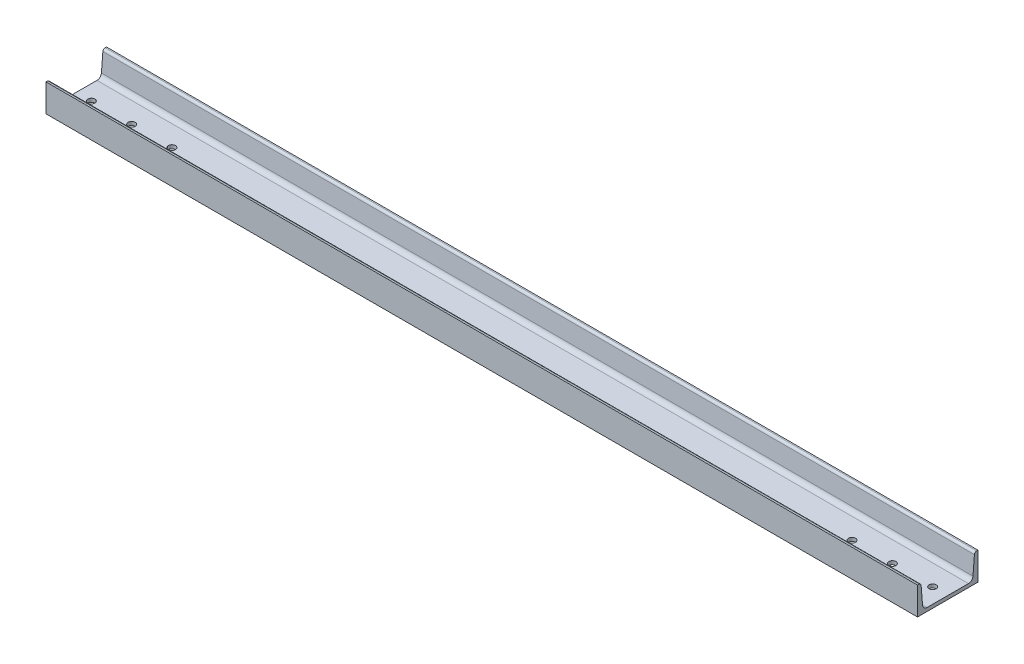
ISO-10303-21;
HEADER;
FILE_DESCRIPTION(('STEP AP214'),'2;1');
FILE_NAME('part.step','',(''),(''),'','','');
FILE_SCHEMA(('AUTOMOTIVE_DESIGN { 1 0 10303 214 1 1 1 1 }'));
ENDSEC;
DATA;
#1=APPLICATION_CONTEXT('core data for automotive mechanical design processes');
#2=APPLICATION_PROTOCOL_DEFINITION('international standard','automotive_design',2000,#1);
#3=PRODUCT_CONTEXT('',#1,'mechanical');
#4=PRODUCT('Part','Part','',(#3));
#5=PRODUCT_RELATED_PRODUCT_CATEGORY('part','',(#4));
#6=PRODUCT_DEFINITION_FORMATION('','',#4);
#7=PRODUCT_DEFINITION_CONTEXT('part definition',#1,'design');
#8=PRODUCT_DEFINITION('design','',#6,#7);
#9=PRODUCT_DEFINITION_SHAPE('','',#8);
#10=(LENGTH_UNIT() NAMED_UNIT(*) SI_UNIT(.MILLI.,.METRE.));
#11=(NAMED_UNIT(*) PLANE_ANGLE_UNIT() SI_UNIT($,.RADIAN.));
#12=(NAMED_UNIT(*) SI_UNIT($,.STERADIAN.) SOLID_ANGLE_UNIT());
#13=UNCERTAINTY_MEASURE_WITH_UNIT(LENGTH_MEASURE(1.E-05),#10,'distance_accuracy_value','');
#14=(GEOMETRIC_REPRESENTATION_CONTEXT(3) GLOBAL_UNCERTAINTY_ASSIGNED_CONTEXT((#13)) GLOBAL_UNIT_ASSIGNED_CONTEXT((#10,
#11,#12)) REPRESENTATION_CONTEXT('',''));
#15=CARTESIAN_POINT('',(0.,0.,0.));
#16=DIRECTION('',(0.,0.,1.));
#17=DIRECTION('',(1.,0.,0.));
#18=AXIS2_PLACEMENT_3D('',#15,#16,#17);
#19=CARTESIAN_POINT('',(865.,7.,-41.0520874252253));
#20=DIRECTION('',(0.,-1.,0.));
#21=DIRECTION('',(0.,0.,-1.));
#22=AXIS2_PLACEMENT_3D('',#19,#20,#21);
#23=PLANE('',#22);
#24=CARTESIAN_POINT('',(-755.,7.,0.));
#25=DIRECTION('',(0.,-1.,0.));
#26=DIRECTION('',(0.,0.,-1.));
#27=AXIS2_PLACEMENT_3D('',#24,#25,#26);
#28=CIRCLE('',#27,6.99999999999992);
#29=CARTESIAN_POINT('',(-755.,7.,-6.99999999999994));
#30=VERTEX_POINT('',#29);
#31=EDGE_CURVE('E287',#30,#30,#28,.F.);
#32=ORIENTED_EDGE('',*,*,#31,.F.);
#33=EDGE_LOOP('',(#32));
#34=FACE_BOUND('',#33,.T.);
#35=DIRECTION('',(0.,0.,1.));
#36=VECTOR('',#35,1.);
#37=CARTESIAN_POINT('',(-865.,7.,-41.0520874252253));
#38=LINE('',#37,#36);
#39=CARTESIAN_POINT('',(-865.,7.,-41.0520874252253));
#40=VERTEX_POINT('',#39);
#41=CARTESIAN_POINT('',(-865.,7.,41.0520874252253));
#42=VERTEX_POINT('',#41);
#43=EDGE_CURVE('E150',#40,#42,#38,.T.);
#44=ORIENTED_EDGE('',*,*,#43,.T.);
#45=DIRECTION('',(-1.,0.,0.));
#46=VECTOR('',#45,1.);
#47=CARTESIAN_POINT('',(865.,7.,41.0520874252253));
#48=LINE('',#47,#46);
#49=CARTESIAN_POINT('',(865.,7.,41.0520874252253));
#50=VERTEX_POINT('',#49);
#51=EDGE_CURVE('E201',#50,#42,#48,.T.);
#52=ORIENTED_EDGE('',*,*,#51,.F.);
#53=DIRECTION('',(0.,0.,1.));
#54=VECTOR('',#53,1.);
#55=CARTESIAN_POINT('',(865.,7.,-41.0520874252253));
#56=LINE('',#55,#54);
#57=CARTESIAN_POINT('',(865.,7.,-41.0520874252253));
#58=VERTEX_POINT('',#57);
#59=EDGE_CURVE('E173',#58,#50,#56,.T.);
#60=ORIENTED_EDGE('',*,*,#59,.F.);
#61=DIRECTION('',(-1.,0.,0.));
#62=VECTOR('',#61,1.);
#63=CARTESIAN_POINT('',(865.,7.,-41.0520874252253));
#64=LINE('',#63,#62);
#65=EDGE_CURVE('E204',#58,#40,#64,.T.);
#66=ORIENTED_EDGE('',*,*,#65,.T.);
#67=EDGE_LOOP('',(#44,#52,#60,#66));
#68=FACE_BOUND('',#67,.T.);
#69=CARTESIAN_POINT('',(835.,7.,0.));
#70=DIRECTION('',(0.,-1.,0.));
#71=DIRECTION('',(0.,0.,-1.));
#72=AXIS2_PLACEMENT_3D('',#69,#70,#71);
#73=CIRCLE('',#72,6.99999999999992);
#74=CARTESIAN_POINT('',(835.,7.,-6.99999999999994));
#75=VERTEX_POINT('',#74);
#76=EDGE_CURVE('E138',#75,#75,#73,.T.);
#77=ORIENTED_EDGE('',*,*,#76,.T.);
#78=EDGE_LOOP('',(#77));
#79=FACE_BOUND('',#78,.T.);
#80=CARTESIAN_POINT('',(755.,7.,0.));
#81=DIRECTION('',(0.,-1.,0.));
#82=DIRECTION('',(0.,0.,-1.));
#83=AXIS2_PLACEMENT_3D('',#80,#81,#82);
#84=CIRCLE('',#83,6.99999999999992);
#85=CARTESIAN_POINT('',(755.,7.,-6.99999999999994));
#86=VERTEX_POINT('',#85);
#87=EDGE_CURVE('E299',#86,#86,#84,.T.);
#88=ORIENTED_EDGE('',*,*,#87,.T.);
#89=EDGE_LOOP('',(#88));
#90=FACE_BOUND('',#89,.T.);
#91=CARTESIAN_POINT('',(675.,7.,0.));
#92=DIRECTION('',(0.,-1.,0.));
#93=DIRECTION('',(0.,0.,-1.));
#94=AXIS2_PLACEMENT_3D('',#91,#92,#93);
#95=CIRCLE('',#94,6.99999999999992);
#96=CARTESIAN_POINT('',(675.,7.,-6.99999999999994));
#97=VERTEX_POINT('',#96);
#98=EDGE_CURVE('E295',#97,#97,#95,.T.);
#99=ORIENTED_EDGE('',*,*,#98,.T.);
#100=EDGE_LOOP('',(#99));
#101=FACE_BOUND('',#100,.T.);
#102=CARTESIAN_POINT('',(-835.,7.,0.));
#103=DIRECTION('',(0.,-1.,0.));
#104=DIRECTION('',(0.,0.,-1.));
#105=AXIS2_PLACEMENT_3D('',#102,#103,#104);
#106=CIRCLE('',#105,6.99999999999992);
#107=CARTESIAN_POINT('',(-835.,7.,-6.99999999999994));
#108=VERTEX_POINT('',#107);
#109=EDGE_CURVE('E291',#108,#108,#106,.F.);
#110=ORIENTED_EDGE('',*,*,#109,.F.);
#111=EDGE_LOOP('',(#110));
#112=FACE_BOUND('',#111,.T.);
#113=CARTESIAN_POINT('',(-675.,7.,0.));
#114=DIRECTION('',(0.,-1.,0.));
#115=DIRECTION('',(0.,0.,-1.));
#116=AXIS2_PLACEMENT_3D('',#113,#114,#115);
#117=CIRCLE('',#116,6.99999999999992);
#118=CARTESIAN_POINT('',(-675.,7.,-6.99999999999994));
#119=VERTEX_POINT('',#118);
#120=EDGE_CURVE('E279',#119,#119,#117,.F.);
#121=ORIENTED_EDGE('',*,*,#120,.F.);
#122=EDGE_LOOP('',(#121));
#123=FACE_BOUND('',#122,.T.);
#124=ADVANCED_FACE('F31',(#34,#68,#79,#90,#101,#112,#123),#23,.F.);
#125=CARTESIAN_POINT('',(865.,0.,60.));
#126=DIRECTION('',(0.,1.,0.));
#127=DIRECTION('',(0.,0.,1.));
#128=AXIS2_PLACEMENT_3D('',#125,#126,#127);
#129=PLANE('',#128);
#130=CARTESIAN_POINT('',(-755.,0.,0.));
#131=DIRECTION('',(0.,1.,0.));
#132=DIRECTION('',(0.,0.,-1.));
#133=AXIS2_PLACEMENT_3D('',#130,#131,#132);
#134=CIRCLE('',#133,6.99999999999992);
#135=CARTESIAN_POINT('',(-755.,0.,-6.99999999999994));
#136=VERTEX_POINT('',#135);
#137=EDGE_CURVE('E282',#136,#136,#134,.T.);
#138=ORIENTED_EDGE('',*,*,#137,.T.);
#139=EDGE_LOOP('',(#138));
#140=FACE_BOUND('',#139,.T.);
#141=DIRECTION('',(0.,0.,-1.));
#142=VECTOR('',#141,1.);
#143=CARTESIAN_POINT('',(-865.,0.,60.));
#144=LINE('',#143,#142);
#145=CARTESIAN_POINT('',(-865.,0.,60.));
#146=VERTEX_POINT('',#145);
#147=CARTESIAN_POINT('',(-865.,0.,-60.));
#148=VERTEX_POINT('',#147);
#149=EDGE_CURVE('E162',#146,#148,#144,.T.);
#150=ORIENTED_EDGE('',*,*,#149,.T.);
#151=DIRECTION('',(-1.,0.,0.));
#152=VECTOR('',#151,1.);
#153=CARTESIAN_POINT('',(865.,0.,-60.));
#154=LINE('',#153,#152);
#155=CARTESIAN_POINT('',(865.,0.,-60.));
#156=VERTEX_POINT('',#155);
#157=EDGE_CURVE('E137',#156,#148,#154,.T.);
#158=ORIENTED_EDGE('',*,*,#157,.F.);
#159=DIRECTION('',(0.,0.,-1.));
#160=VECTOR('',#159,1.);
#161=CARTESIAN_POINT('',(865.,0.,60.));
#162=LINE('',#161,#160);
#163=CARTESIAN_POINT('',(865.,0.,60.));
#164=VERTEX_POINT('',#163);
#165=EDGE_CURVE('E46',#164,#156,#162,.T.);
#166=ORIENTED_EDGE('',*,*,#165,.F.);
#167=DIRECTION('',(-1.,0.,0.));
#168=VECTOR('',#167,1.);
#169=CARTESIAN_POINT('',(865.,0.,60.));
#170=LINE('',#169,#168);
#171=EDGE_CURVE('E186',#164,#146,#170,.T.);
#172=ORIENTED_EDGE('',*,*,#171,.T.);
#173=EDGE_LOOP('',(#150,#158,#166,#172));
#174=FACE_BOUND('',#173,.T.);
#175=CARTESIAN_POINT('',(835.,0.,0.));
#176=DIRECTION('',(0.,-1.,0.));
#177=DIRECTION('',(0.,0.,-1.));
#178=AXIS2_PLACEMENT_3D('',#175,#176,#177);
#179=CIRCLE('',#178,6.99999999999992);
#180=CARTESIAN_POINT('',(835.,0.,-6.99999999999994));
#181=VERTEX_POINT('',#180);
#182=EDGE_CURVE('E141',#181,#181,#179,.T.);
#183=ORIENTED_EDGE('',*,*,#182,.F.);
#184=EDGE_LOOP('',(#183));
#185=FACE_BOUND('',#184,.T.);
#186=CARTESIAN_POINT('',(755.,0.,0.));
#187=DIRECTION('',(0.,-1.,0.));
#188=DIRECTION('',(0.,0.,-1.));
#189=AXIS2_PLACEMENT_3D('',#186,#187,#188);
#190=CIRCLE('',#189,6.99999999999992);
#191=CARTESIAN_POINT('',(755.,0.,-6.99999999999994));
#192=VERTEX_POINT('',#191);
#193=EDGE_CURVE('E266',#192,#192,#190,.T.);
#194=ORIENTED_EDGE('',*,*,#193,.F.);
#195=EDGE_LOOP('',(#194));
#196=FACE_BOUND('',#195,.T.);
#197=CARTESIAN_POINT('',(675.,0.,0.));
#198=DIRECTION('',(0.,-1.,0.));
#199=DIRECTION('',(0.,0.,-1.));
#200=AXIS2_PLACEMENT_3D('',#197,#198,#199);
#201=CIRCLE('',#200,6.99999999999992);
#202=CARTESIAN_POINT('',(675.,0.,-6.99999999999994));
#203=VERTEX_POINT('',#202);
#204=EDGE_CURVE('E270',#203,#203,#201,.T.);
#205=ORIENTED_EDGE('',*,*,#204,.F.);
#206=EDGE_LOOP('',(#205));
#207=FACE_BOUND('',#206,.T.);
#208=CARTESIAN_POINT('',(-835.,0.,0.));
#209=DIRECTION('',(0.,1.,0.));
#210=DIRECTION('',(0.,0.,-1.));
#211=AXIS2_PLACEMENT_3D('',#208,#209,#210);
#212=CIRCLE('',#211,6.99999999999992);
#213=CARTESIAN_POINT('',(-835.,0.,-6.99999999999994));
#214=VERTEX_POINT('',#213);
#215=EDGE_CURVE('E274',#214,#214,#212,.T.);
#216=ORIENTED_EDGE('',*,*,#215,.T.);
#217=EDGE_LOOP('',(#216));
#218=FACE_BOUND('',#217,.T.);
#219=CARTESIAN_POINT('',(-675.,0.,0.));
#220=DIRECTION('',(0.,1.,0.));
#221=DIRECTION('',(0.,0.,-1.));
#222=AXIS2_PLACEMENT_3D('',#219,#220,#221);
#223=CIRCLE('',#222,6.99999999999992);
#224=CARTESIAN_POINT('',(-675.,0.,-6.99999999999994));
#225=VERTEX_POINT('',#224);
#226=EDGE_CURVE('E277',#225,#225,#223,.T.);
#227=ORIENTED_EDGE('',*,*,#226,.T.);
#228=EDGE_LOOP('',(#227));
#229=FACE_BOUND('',#228,.T.);
#230=ADVANCED_FACE('F255',(#140,#174,#185,#196,#207,#218,#229),#129,.F.);
#231=CARTESIAN_POINT('',(865.,0.,-60.));
#232=DIRECTION('',(0.,0.,1.));
#233=DIRECTION('',(0.,-1.,0.));
#234=AXIS2_PLACEMENT_3D('',#231,#232,#233);
#235=PLANE('',#234);
#236=DIRECTION('',(0.,1.,0.));
#237=VECTOR('',#236,1.);
#238=CARTESIAN_POINT('',(-865.,0.,-60.));
#239=LINE('',#238,#237);
#240=CARTESIAN_POINT('',(-865.,55.,-60.));
#241=VERTEX_POINT('',#240);
#242=EDGE_CURVE('E124',#148,#241,#239,.T.);
#243=ORIENTED_EDGE('',*,*,#242,.T.);
#244=DIRECTION('',(-1.,0.,0.));
#245=VECTOR('',#244,1.);
#246=CARTESIAN_POINT('',(865.,55.,-60.));
#247=LINE('',#246,#245);
#248=CARTESIAN_POINT('',(865.,55.,-60.));
#249=VERTEX_POINT('',#248);
#250=EDGE_CURVE('E11',#249,#241,#247,.T.);
#251=ORIENTED_EDGE('',*,*,#250,.F.);
#252=DIRECTION('',(0.,1.,0.));
#253=VECTOR('',#252,1.);
#254=CARTESIAN_POINT('',(865.,0.,-60.));
#255=LINE('',#254,#253);
#256=EDGE_CURVE('E164',#156,#249,#255,.T.);
#257=ORIENTED_EDGE('',*,*,#256,.F.);
#258=ORIENTED_EDGE('',*,*,#157,.T.);
#259=EDGE_LOOP('',(#243,#251,#257,#258));
#260=FACE_BOUND('',#259,.T.);
#261=ADVANCED_FACE('F33',(#260),#235,.F.);
#262=CARTESIAN_POINT('',(865.,55.,-60.));
#263=DIRECTION('',(0.,-1.,0.));
#264=DIRECTION('',(0.,0.,-1.));
#265=AXIS2_PLACEMENT_3D('',#262,#263,#264);
#266=PLANE('',#265);
#267=DIRECTION('',(0.,0.,1.));
#268=VECTOR('',#267,1.);
#269=CARTESIAN_POINT('',(-865.,55.,-60.));
#270=LINE('',#269,#268);
#271=CARTESIAN_POINT('',(-865.,55.,-57.3527681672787));
#272=VERTEX_POINT('',#271);
#273=EDGE_CURVE('E120',#241,#272,#270,.T.);
#274=ORIENTED_EDGE('',*,*,#273,.T.);
#275=DIRECTION('',(-1.,0.,0.));
#276=VECTOR('',#275,1.);
#277=CARTESIAN_POINT('',(865.,55.,-57.3527681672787));
#278=LINE('',#277,#276);
#279=CARTESIAN_POINT('',(865.,55.,-57.3527681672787));
#280=VERTEX_POINT('',#279);
#281=EDGE_CURVE('E39',#280,#272,#278,.T.);
#282=ORIENTED_EDGE('',*,*,#281,.F.);
#283=DIRECTION('',(0.,0.,1.));
#284=VECTOR('',#283,1.);
#285=CARTESIAN_POINT('',(865.,55.,-60.));
#286=LINE('',#285,#284);
#287=EDGE_CURVE('E133',#249,#280,#286,.T.);
#288=ORIENTED_EDGE('',*,*,#287,.F.);
#289=ORIENTED_EDGE('',*,*,#250,.T.);
#290=EDGE_LOOP('',(#274,#282,#288,#289));
#291=FACE_BOUND('',#290,.T.);
#292=ADVANCED_FACE('F132',(#291),#266,.F.);
#293=CARTESIAN_POINT('',(865.,50.5,-57.3527681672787));
#294=DIRECTION('',(-1.,0.,0.));
#295=DIRECTION('',(0.,0.,1.));
#296=AXIS2_PLACEMENT_3D('',#293,#294,#295);
#297=CYLINDRICAL_SURFACE('',#296,4.5);
#298=CARTESIAN_POINT('',(-865.,50.5,-57.3527681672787));
#299=DIRECTION('',(1.,0.,0.));
#300=DIRECTION('',(0.,0.,-1.));
#301=AXIS2_PLACEMENT_3D('',#298,#299,#300);
#302=CIRCLE('',#301,4.5);
#303=CARTESIAN_POINT('',(-865.,50.8585465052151,-52.8670748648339));
#304=VERTEX_POINT('',#303);
#305=EDGE_CURVE('E126',#272,#304,#302,.T.);
#306=ORIENTED_EDGE('',*,*,#305,.T.);
#307=DIRECTION('',(-1.,0.,0.));
#308=VECTOR('',#307,1.);
#309=CARTESIAN_POINT('',(865.,50.8585465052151,-52.8670748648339));
#310=LINE('',#309,#308);
#311=CARTESIAN_POINT('',(865.,50.8585465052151,-52.8670748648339));
#312=VERTEX_POINT('',#311);
#313=EDGE_CURVE('E210',#312,#304,#310,.T.);
#314=ORIENTED_EDGE('',*,*,#313,.F.);
#315=CARTESIAN_POINT('',(865.,50.5,-57.3527681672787));
#316=DIRECTION('',(1.,0.,0.));
#317=DIRECTION('',(0.,0.,-1.));
#318=AXIS2_PLACEMENT_3D('',#315,#316,#317);
#319=CIRCLE('',#318,4.5);
#320=EDGE_CURVE('E167',#280,#312,#319,.T.);
#321=ORIENTED_EDGE('',*,*,#320,.F.);
#322=ORIENTED_EDGE('',*,*,#281,.T.);
#323=EDGE_LOOP('',(#306,#314,#321,#322));
#324=FACE_BOUND('',#323,.T.);
#325=ADVANCED_FACE('F214',(#324),#297,.T.);
#326=CARTESIAN_POINT('',(865.,50.8585465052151,-52.8670748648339));
#327=DIRECTION('',(0.,-0.0796770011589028,-0.99682073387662));
#328=DIRECTION('',(0.,0.996820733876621,-0.0796770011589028));
#329=AXIS2_PLACEMENT_3D('',#326,#327,#328);
#330=PLANE('',#329);
#331=DIRECTION('',(0.,-0.99682073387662,0.0796770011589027));
#332=VECTOR('',#331,1.);
#333=CARTESIAN_POINT('',(-865.,50.8585465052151,-52.8670748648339));
#334=LINE('',#333,#332);
#335=CARTESIAN_POINT('',(-865.,15.2829069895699,-50.0234740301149));
#336=VERTEX_POINT('',#335);
#337=EDGE_CURVE('E146',#304,#336,#334,.T.);
#338=ORIENTED_EDGE('',*,*,#337,.T.);
#339=DIRECTION('',(-1.,0.,0.));
#340=VECTOR('',#339,1.);
#341=CARTESIAN_POINT('',(865.,15.2829069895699,-50.0234740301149));
#342=LINE('',#341,#340);
#343=CARTESIAN_POINT('',(865.,15.2829069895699,-50.0234740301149));
#344=VERTEX_POINT('',#343);
#345=EDGE_CURVE('E207',#344,#336,#342,.T.);
#346=ORIENTED_EDGE('',*,*,#345,.F.);
#347=DIRECTION('',(0.,-0.99682073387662,0.0796770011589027));
#348=VECTOR('',#347,1.);
#349=CARTESIAN_POINT('',(865.,50.8585465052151,-52.8670748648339));
#350=LINE('',#349,#348);
#351=EDGE_CURVE('E169',#312,#344,#350,.T.);
#352=ORIENTED_EDGE('',*,*,#351,.F.);
#353=ORIENTED_EDGE('',*,*,#313,.T.);
#354=EDGE_LOOP('',(#338,#346,#352,#353));
#355=FACE_BOUND('',#354,.T.);
#356=ADVANCED_FACE('F222',(#355),#330,.F.);
#357=CARTESIAN_POINT('',(865.,16.,-41.0520874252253));
#358=DIRECTION('',(-1.,0.,0.));
#359=DIRECTION('',(0.,0.,1.));
#360=AXIS2_PLACEMENT_3D('',#357,#358,#359);
#361=CYLINDRICAL_SURFACE('',#360,9.);
#362=CARTESIAN_POINT('',(-865.,16.,-41.0520874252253));
#363=DIRECTION('',(-1.,0.,0.));
#364=DIRECTION('',(0.,0.,1.));
#365=AXIS2_PLACEMENT_3D('',#362,#363,#364);
#366=CIRCLE('',#365,9.);
#367=EDGE_CURVE('E148',#336,#40,#366,.T.);
#368=ORIENTED_EDGE('',*,*,#367,.T.);
#369=ORIENTED_EDGE('',*,*,#65,.F.);
#370=CARTESIAN_POINT('',(865.,16.,-41.0520874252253));
#371=DIRECTION('',(-1.,0.,0.));
#372=DIRECTION('',(0.,0.,1.));
#373=AXIS2_PLACEMENT_3D('',#370,#371,#372);
#374=CIRCLE('',#373,9.);
#375=EDGE_CURVE('E171',#344,#58,#374,.T.);
#376=ORIENTED_EDGE('',*,*,#375,.F.);
#377=ORIENTED_EDGE('',*,*,#345,.T.);
#378=EDGE_LOOP('',(#368,#369,#376,#377));
#379=FACE_BOUND('',#378,.T.);
#380=ADVANCED_FACE('F225',(#379),#361,.F.);
#381=CARTESIAN_POINT('',(865.,16.,41.0520874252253));
#382=DIRECTION('',(-1.,0.,0.));
#383=DIRECTION('',(0.,0.,1.));
#384=AXIS2_PLACEMENT_3D('',#381,#382,#383);
#385=CYLINDRICAL_SURFACE('',#384,9.);
#386=CARTESIAN_POINT('',(-865.,16.,41.0520874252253));
#387=DIRECTION('',(-1.,0.,0.));
#388=DIRECTION('',(0.,0.,-1.));
#389=AXIS2_PLACEMENT_3D('',#386,#387,#388);
#390=CIRCLE('',#389,9.);
#391=CARTESIAN_POINT('',(-865.,15.2829069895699,50.0234740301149));
#392=VERTEX_POINT('',#391);
#393=EDGE_CURVE('E152',#42,#392,#390,.T.);
#394=ORIENTED_EDGE('',*,*,#393,.T.);
#395=DIRECTION('',(-1.,0.,0.));
#396=VECTOR('',#395,1.);
#397=CARTESIAN_POINT('',(865.,15.2829069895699,50.0234740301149));
#398=LINE('',#397,#396);
#399=CARTESIAN_POINT('',(865.,15.2829069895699,50.0234740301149));
#400=VERTEX_POINT('',#399);
#401=EDGE_CURVE('E198',#400,#392,#398,.T.);
#402=ORIENTED_EDGE('',*,*,#401,.F.);
#403=CARTESIAN_POINT('',(865.,16.,41.0520874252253));
#404=DIRECTION('',(-1.,0.,0.));
#405=DIRECTION('',(0.,0.,-1.));
#406=AXIS2_PLACEMENT_3D('',#403,#404,#405);
#407=CIRCLE('',#406,9.);
#408=EDGE_CURVE('E175',#50,#400,#407,.T.);
#409=ORIENTED_EDGE('',*,*,#408,.F.);
#410=ORIENTED_EDGE('',*,*,#51,.T.);
#411=EDGE_LOOP('',(#394,#402,#409,#410));
#412=FACE_BOUND('',#411,.T.);
#413=ADVANCED_FACE('F236',(#412),#385,.F.);
#414=CARTESIAN_POINT('',(865.,50.8585465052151,52.8670748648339));
#415=DIRECTION('',(0.,-0.0796770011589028,0.99682073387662));
#416=DIRECTION('',(0.,-0.996820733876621,-0.0796770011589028));
#417=AXIS2_PLACEMENT_3D('',#414,#415,#416);
#418=PLANE('',#417);
#419=DIRECTION('',(0.,0.99682073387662,0.0796770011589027));
#420=VECTOR('',#419,1.);
#421=CARTESIAN_POINT('',(-865.,50.8585465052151,52.8670748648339));
#422=LINE('',#421,#420);
#423=CARTESIAN_POINT('',(-865.,50.8585465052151,52.8670748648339));
#424=VERTEX_POINT('',#423);
#425=EDGE_CURVE('E154',#392,#424,#422,.T.);
#426=ORIENTED_EDGE('',*,*,#425,.T.);
#427=DIRECTION('',(-1.,0.,0.));
#428=VECTOR('',#427,1.);
#429=CARTESIAN_POINT('',(865.,50.8585465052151,52.8670748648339));
#430=LINE('',#429,#428);
#431=CARTESIAN_POINT('',(865.,50.8585465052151,52.8670748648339));
#432=VERTEX_POINT('',#431);
#433=EDGE_CURVE('E195',#432,#424,#430,.T.);
#434=ORIENTED_EDGE('',*,*,#433,.F.);
#435=DIRECTION('',(0.,0.99682073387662,0.0796770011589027));
#436=VECTOR('',#435,1.);
#437=CARTESIAN_POINT('',(865.,50.8585465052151,52.8670748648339));
#438=LINE('',#437,#436);
#439=EDGE_CURVE('E177',#400,#432,#438,.T.);
#440=ORIENTED_EDGE('',*,*,#439,.F.);
#441=ORIENTED_EDGE('',*,*,#401,.T.);
#442=EDGE_LOOP('',(#426,#434,#440,#441));
#443=FACE_BOUND('',#442,.T.);
#444=ADVANCED_FACE('F240',(#443),#418,.F.);
#445=CARTESIAN_POINT('',(865.,50.5,57.3527681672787));
#446=DIRECTION('',(-1.,0.,0.));
#447=DIRECTION('',(0.,0.,1.));
#448=AXIS2_PLACEMENT_3D('',#445,#446,#447);
#449=CYLINDRICAL_SURFACE('',#448,4.5);
#450=CARTESIAN_POINT('',(-865.,50.5,57.3527681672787));
#451=DIRECTION('',(1.,0.,0.));
#452=DIRECTION('',(0.,0.,1.));
#453=AXIS2_PLACEMENT_3D('',#450,#451,#452);
#454=CIRCLE('',#453,4.5);
#455=CARTESIAN_POINT('',(-865.,55.,57.3527681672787));
#456=VERTEX_POINT('',#455);
#457=EDGE_CURVE('E156',#424,#456,#454,.T.);
#458=ORIENTED_EDGE('',*,*,#457,.T.);
#459=DIRECTION('',(-1.,0.,0.));
#460=VECTOR('',#459,1.);
#461=CARTESIAN_POINT('',(865.,55.,57.3527681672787));
#462=LINE('',#461,#460);
#463=CARTESIAN_POINT('',(865.,55.,57.3527681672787));
#464=VERTEX_POINT('',#463);
#465=EDGE_CURVE('E192',#464,#456,#462,.T.);
#466=ORIENTED_EDGE('',*,*,#465,.F.);
#467=CARTESIAN_POINT('',(865.,50.5,57.3527681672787));
#468=DIRECTION('',(1.,0.,0.));
#469=DIRECTION('',(0.,0.,1.));
#470=AXIS2_PLACEMENT_3D('',#467,#468,#469);
#471=CIRCLE('',#470,4.5);
#472=EDGE_CURVE('E179',#432,#464,#471,.T.);
#473=ORIENTED_EDGE('',*,*,#472,.F.);
#474=ORIENTED_EDGE('',*,*,#433,.T.);
#475=EDGE_LOOP('',(#458,#466,#473,#474));
#476=FACE_BOUND('',#475,.T.);
#477=ADVANCED_FACE('F245',(#476),#449,.T.);
#478=CARTESIAN_POINT('',(865.,55.,60.));
#479=DIRECTION('',(0.,-1.,0.));
#480=DIRECTION('',(0.,0.,-1.));
#481=AXIS2_PLACEMENT_3D('',#478,#479,#480);
#482=PLANE('',#481);
#483=DIRECTION('',(0.,0.,1.));
#484=VECTOR('',#483,1.);
#485=CARTESIAN_POINT('',(-865.,55.,60.));
#486=LINE('',#485,#484);
#487=CARTESIAN_POINT('',(-865.,55.,60.));
#488=VERTEX_POINT('',#487);
#489=EDGE_CURVE('E158',#456,#488,#486,.T.);
#490=ORIENTED_EDGE('',*,*,#489,.T.);
#491=DIRECTION('',(-1.,0.,0.));
#492=VECTOR('',#491,1.);
#493=CARTESIAN_POINT('',(865.,55.,60.));
#494=LINE('',#493,#492);
#495=CARTESIAN_POINT('',(865.,55.,60.));
#496=VERTEX_POINT('',#495);
#497=EDGE_CURVE('E189',#496,#488,#494,.T.);
#498=ORIENTED_EDGE('',*,*,#497,.F.);
#499=DIRECTION('',(0.,0.,1.));
#500=VECTOR('',#499,1.);
#501=CARTESIAN_POINT('',(865.,55.,60.));
#502=LINE('',#501,#500);
#503=EDGE_CURVE('E181',#464,#496,#502,.T.);
#504=ORIENTED_EDGE('',*,*,#503,.F.);
#505=ORIENTED_EDGE('',*,*,#465,.T.);
#506=EDGE_LOOP('',(#490,#498,#504,#505));
#507=FACE_BOUND('',#506,.T.);
#508=ADVANCED_FACE('F249',(#507),#482,.F.);
#509=CARTESIAN_POINT('',(865.,0.,60.));
#510=DIRECTION('',(0.,0.,-1.));
#511=DIRECTION('',(0.,1.,0.));
#512=AXIS2_PLACEMENT_3D('',#509,#510,#511);
#513=PLANE('',#512);
#514=DIRECTION('',(0.,-1.,0.));
#515=VECTOR('',#514,1.);
#516=CARTESIAN_POINT('',(-865.,0.,60.));
#517=LINE('',#516,#515);
#518=EDGE_CURVE('E160',#488,#146,#517,.T.);
#519=ORIENTED_EDGE('',*,*,#518,.T.);
#520=ORIENTED_EDGE('',*,*,#171,.F.);
#521=DIRECTION('',(0.,-1.,0.));
#522=VECTOR('',#521,1.);
#523=CARTESIAN_POINT('',(865.,0.,60.));
#524=LINE('',#523,#522);
#525=EDGE_CURVE('E51',#496,#164,#524,.T.);
#526=ORIENTED_EDGE('',*,*,#525,.F.);
#527=ORIENTED_EDGE('',*,*,#497,.T.);
#528=EDGE_LOOP('',(#519,#520,#526,#527));
#529=FACE_BOUND('',#528,.T.);
#530=ADVANCED_FACE('F253',(#529),#513,.F.);
#531=CARTESIAN_POINT('',(865.,50.5,-57.3527681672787));
#532=DIRECTION('',(1.,0.,0.));
#533=DIRECTION('',(0.,0.,-1.));
#534=AXIS2_PLACEMENT_3D('',#531,#532,#533);
#535=PLANE('',#534);
#536=ORIENTED_EDGE('',*,*,#256,.T.);
#537=ORIENTED_EDGE('',*,*,#287,.T.);
#538=ORIENTED_EDGE('',*,*,#320,.T.);
#539=ORIENTED_EDGE('',*,*,#351,.T.);
#540=ORIENTED_EDGE('',*,*,#375,.T.);
#541=ORIENTED_EDGE('',*,*,#59,.T.);
#542=ORIENTED_EDGE('',*,*,#408,.T.);
#543=ORIENTED_EDGE('',*,*,#439,.T.);
#544=ORIENTED_EDGE('',*,*,#472,.T.);
#545=ORIENTED_EDGE('',*,*,#503,.T.);
#546=ORIENTED_EDGE('',*,*,#525,.T.);
#547=ORIENTED_EDGE('',*,*,#165,.T.);
#548=EDGE_LOOP('',(#536,#537,#538,#539,#540,#541,#542,#543,#544,#545,#546,#547));
#549=FACE_BOUND('',#548,.T.);
#550=ADVANCED_FACE('F217',(#549),#535,.T.);
#551=CARTESIAN_POINT('',(-865.,50.5,-57.3527681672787));
#552=DIRECTION('',(1.,0.,0.));
#553=DIRECTION('',(0.,0.,-1.));
#554=AXIS2_PLACEMENT_3D('',#551,#552,#553);
#555=PLANE('',#554);
#556=ORIENTED_EDGE('',*,*,#242,.F.);
#557=ORIENTED_EDGE('',*,*,#149,.F.);
#558=ORIENTED_EDGE('',*,*,#518,.F.);
#559=ORIENTED_EDGE('',*,*,#489,.F.);
#560=ORIENTED_EDGE('',*,*,#457,.F.);
#561=ORIENTED_EDGE('',*,*,#425,.F.);
#562=ORIENTED_EDGE('',*,*,#393,.F.);
#563=ORIENTED_EDGE('',*,*,#43,.F.);
#564=ORIENTED_EDGE('',*,*,#367,.F.);
#565=ORIENTED_EDGE('',*,*,#337,.F.);
#566=ORIENTED_EDGE('',*,*,#305,.F.);
#567=ORIENTED_EDGE('',*,*,#273,.F.);
#568=EDGE_LOOP('',(#556,#557,#558,#559,#560,#561,#562,#563,#564,#565,#566,#567));
#569=FACE_BOUND('',#568,.T.);
#570=ADVANCED_FACE('F121',(#569),#555,.F.);
#571=CARTESIAN_POINT('',(835.,55.,0.));
#572=DIRECTION('',(0.,-1.,0.));
#573=DIRECTION('',(0.,0.,-1.));
#574=AXIS2_PLACEMENT_3D('',#571,#572,#573);
#575=CYLINDRICAL_SURFACE('',#574,6.99999999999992);
#576=ORIENTED_EDGE('',*,*,#182,.T.);
#577=EDGE_LOOP('',(#576));
#578=FACE_BOUND('',#577,.T.);
#579=ORIENTED_EDGE('',*,*,#76,.F.);
#580=EDGE_LOOP('',(#579));
#581=FACE_BOUND('',#580,.T.);
#582=ADVANCED_FACE('F302',(#578,#581),#575,.F.);
#583=CARTESIAN_POINT('',(755.,55.,0.));
#584=DIRECTION('',(0.,-1.,0.));
#585=DIRECTION('',(0.,0.,-1.));
#586=AXIS2_PLACEMENT_3D('',#583,#584,#585);
#587=CYLINDRICAL_SURFACE('',#586,6.99999999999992);
#588=ORIENTED_EDGE('',*,*,#193,.T.);
#589=EDGE_LOOP('',(#588));
#590=FACE_BOUND('',#589,.T.);
#591=ORIENTED_EDGE('',*,*,#87,.F.);
#592=EDGE_LOOP('',(#591));
#593=FACE_BOUND('',#592,.T.);
#594=ADVANCED_FACE('F305',(#590,#593),#587,.F.);
#595=CARTESIAN_POINT('',(675.,55.,0.));
#596=DIRECTION('',(0.,-1.,0.));
#597=DIRECTION('',(0.,0.,-1.));
#598=AXIS2_PLACEMENT_3D('',#595,#596,#597);
#599=CYLINDRICAL_SURFACE('',#598,6.99999999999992);
#600=ORIENTED_EDGE('',*,*,#204,.T.);
#601=EDGE_LOOP('',(#600));
#602=FACE_BOUND('',#601,.T.);
#603=ORIENTED_EDGE('',*,*,#98,.F.);
#604=EDGE_LOOP('',(#603));
#605=FACE_BOUND('',#604,.T.);
#606=ADVANCED_FACE('F333',(#602,#605),#599,.F.);
#607=CARTESIAN_POINT('',(-835.,55.,0.));
#608=DIRECTION('',(0.,-1.,0.));
#609=DIRECTION('',(0.,0.,-1.));
#610=AXIS2_PLACEMENT_3D('',#607,#608,#609);
#611=CYLINDRICAL_SURFACE('',#610,6.99999999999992);
#612=ORIENTED_EDGE('',*,*,#215,.F.);
#613=EDGE_LOOP('',(#612));
#614=FACE_BOUND('',#613,.T.);
#615=ORIENTED_EDGE('',*,*,#109,.T.);
#616=EDGE_LOOP('',(#615));
#617=FACE_BOUND('',#616,.T.);
#618=ADVANCED_FACE('F327',(#614,#617),#611,.F.);
#619=CARTESIAN_POINT('',(-755.,55.,0.));
#620=DIRECTION('',(0.,-1.,0.));
#621=DIRECTION('',(0.,0.,-1.));
#622=AXIS2_PLACEMENT_3D('',#619,#620,#621);
#623=CYLINDRICAL_SURFACE('',#622,6.99999999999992);
#624=ORIENTED_EDGE('',*,*,#137,.F.);
#625=EDGE_LOOP('',(#624));
#626=FACE_BOUND('',#625,.T.);
#627=ORIENTED_EDGE('',*,*,#31,.T.);
#628=EDGE_LOOP('',(#627));
#629=FACE_BOUND('',#628,.T.);
#630=ADVANCED_FACE('F322',(#626,#629),#623,.F.);
#631=CARTESIAN_POINT('',(-675.,55.,0.));
#632=DIRECTION('',(0.,-1.,0.));
#633=DIRECTION('',(0.,0.,-1.));
#634=AXIS2_PLACEMENT_3D('',#631,#632,#633);
#635=CYLINDRICAL_SURFACE('',#634,6.99999999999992);
#636=ORIENTED_EDGE('',*,*,#226,.F.);
#637=EDGE_LOOP('',(#636));
#638=FACE_BOUND('',#637,.T.);
#639=ORIENTED_EDGE('',*,*,#120,.T.);
#640=EDGE_LOOP('',(#639));
#641=FACE_BOUND('',#640,.T.);
#642=ADVANCED_FACE('F320',(#638,#641),#635,.F.);
#643=CLOSED_SHELL('',(#124,#230,#261,#292,#325,#356,#380,#413,#444,#477,#508,#530,#550,#570,
#582,#594,#606,#618,#630,#642));
#644=MANIFOLD_SOLID_BREP('B2',#643);
#645=ADVANCED_BREP_SHAPE_REPRESENTATION('',(#18,#644),#14);
#646=SHAPE_DEFINITION_REPRESENTATION(#9,#645);
ENDSEC;
END-ISO-10303-21;
